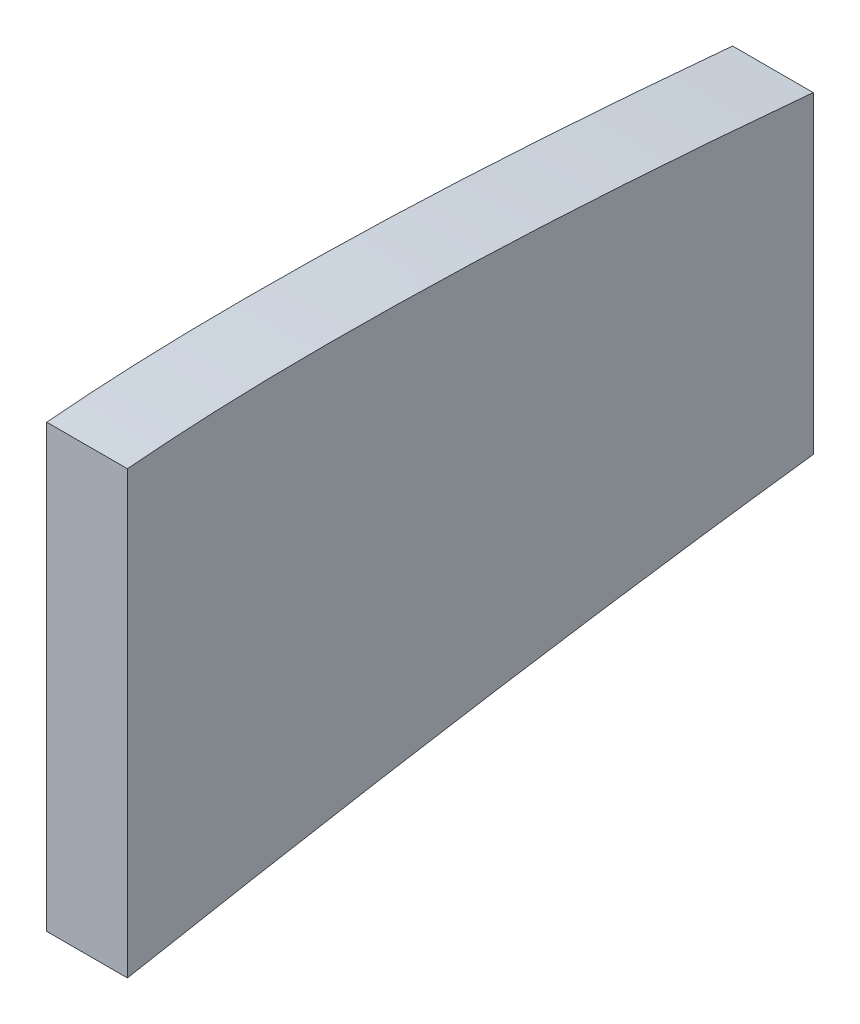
ISO-10303-21;
HEADER;
FILE_DESCRIPTION(('STEP AP214'),'2;1');
FILE_NAME('part.step','',(''),(''),'','','');
FILE_SCHEMA(('AUTOMOTIVE_DESIGN { 1 0 10303 214 1 1 1 1 }'));
ENDSEC;
DATA;
#1=APPLICATION_CONTEXT('core data for automotive mechanical design processes');
#2=APPLICATION_PROTOCOL_DEFINITION('international standard','automotive_design',2000,#1);
#3=PRODUCT_CONTEXT('',#1,'mechanical');
#4=PRODUCT('Part','Part','',(#3));
#5=PRODUCT_RELATED_PRODUCT_CATEGORY('part','',(#4));
#6=PRODUCT_DEFINITION_FORMATION('','',#4);
#7=PRODUCT_DEFINITION_CONTEXT('part definition',#1,'design');
#8=PRODUCT_DEFINITION('design','',#6,#7);
#9=PRODUCT_DEFINITION_SHAPE('','',#8);
#10=(LENGTH_UNIT() NAMED_UNIT(*) SI_UNIT(.MILLI.,.METRE.));
#11=(NAMED_UNIT(*) PLANE_ANGLE_UNIT() SI_UNIT($,.RADIAN.));
#12=(NAMED_UNIT(*) SI_UNIT($,.STERADIAN.) SOLID_ANGLE_UNIT());
#13=UNCERTAINTY_MEASURE_WITH_UNIT(LENGTH_MEASURE(1.E-05),#10,'distance_accuracy_value','');
#14=(GEOMETRIC_REPRESENTATION_CONTEXT(3) GLOBAL_UNCERTAINTY_ASSIGNED_CONTEXT((#13)) GLOBAL_UNIT_ASSIGNED_CONTEXT((#10,
#11,#12)) REPRESENTATION_CONTEXT('',''));
#15=CARTESIAN_POINT('',(0.,0.,0.));
#16=DIRECTION('',(0.,0.,1.));
#17=DIRECTION('',(1.,0.,0.));
#18=AXIS2_PLACEMENT_3D('',#15,#16,#17);
#19=CARTESIAN_POINT('',(3.175,18.8083146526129,-63.5));
#20=CARTESIAN_POINT('',(3.175,18.8858704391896,-62.6475131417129));
#21=CARTESIAN_POINT('',(3.175,19.1104930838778,-60.0791130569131));
#22=CARTESIAN_POINT('',(3.175,19.4275656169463,-55.8473773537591));
#23=CARTESIAN_POINT('',(3.175,19.6930976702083,-50.8648390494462));
#24=CARTESIAN_POINT('',(3.175,19.8086768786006,-46.0697414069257));
#25=CARTESIAN_POINT('',(3.175,19.7981278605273,-41.4866574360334));
#26=CARTESIAN_POINT('',(3.175,19.6365817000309,-38.3248971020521));
#27=CARTESIAN_POINT('',(3.175,19.4986830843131,-36.6955074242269));
#28=CARTESIAN_POINT('',(3.175,19.4825082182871,-36.5125));
#29=B_SPLINE_CURVE_WITH_KNOTS('',3,(#19,#20,#21,#22,#23,#24,#25,#26,#27,#28),.UNSPECIFIED.,.F.,
.F.,(4,1,1,1,1,1,1,4),(1.27949332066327,1.28788677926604,1.30477343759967,1.32110141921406,
1.33680606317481,1.35180003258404,1.36603106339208,1.36783234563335),.UNSPECIFIED.);
#30=DIRECTION('',(-1.,0.,0.));
#31=VECTOR('',#30,1.);
#32=SURFACE_OF_LINEAR_EXTRUSION('',#29,#31);
#33=CARTESIAN_POINT('',(0.,18.8083146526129,-63.5));
#34=CARTESIAN_POINT('',(0.,18.8858704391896,-62.6475131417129));
#35=CARTESIAN_POINT('',(0.,19.1104930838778,-60.0791130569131));
#36=CARTESIAN_POINT('',(0.,19.4275656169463,-55.8473773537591));
#37=CARTESIAN_POINT('',(0.,19.6930976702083,-50.8648390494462));
#38=CARTESIAN_POINT('',(0.,19.8086768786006,-46.0697414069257));
#39=CARTESIAN_POINT('',(0.,19.7981278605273,-41.4866574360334));
#40=CARTESIAN_POINT('',(0.,19.6365817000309,-38.3248971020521));
#41=CARTESIAN_POINT('',(0.,19.4986830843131,-36.6955074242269));
#42=CARTESIAN_POINT('',(0.,19.4825082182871,-36.5125));
#43=B_SPLINE_CURVE_WITH_KNOTS('',3,(#33,#34,#35,#36,#37,#38,#39,#40,#41,#42),.UNSPECIFIED.,.F.,
.F.,(4,1,1,1,1,1,1,4),(1.27949332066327,1.28788677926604,1.30477343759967,1.32110141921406,
1.33680606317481,1.35180003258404,1.36603106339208,1.36783234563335),.UNSPECIFIED.);
#44=CARTESIAN_POINT('',(0.,18.8083146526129,-63.5));
#45=VERTEX_POINT('',#44);
#46=CARTESIAN_POINT('',(0.,19.4825082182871,-36.5125));
#47=VERTEX_POINT('',#46);
#48=EDGE_CURVE('E116',#45,#47,#43,.T.);
#49=ORIENTED_EDGE('',*,*,#48,.T.);
#50=DIRECTION('',(-1.,0.,0.));
#51=VECTOR('',#50,1.);
#52=CARTESIAN_POINT('',(3.175,19.4825082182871,-36.5125));
#53=LINE('',#52,#51);
#54=CARTESIAN_POINT('',(3.175,19.4825082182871,-36.5125));
#55=VERTEX_POINT('',#54);
#56=EDGE_CURVE('E11',#55,#47,#53,.T.);
#57=ORIENTED_EDGE('',*,*,#56,.F.);
#58=CARTESIAN_POINT('',(3.175,18.8083146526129,-63.5));
#59=VERTEX_POINT('',#58);
#60=EDGE_CURVE('E85',#59,#55,#29,.T.);
#61=ORIENTED_EDGE('',*,*,#60,.F.);
#62=DIRECTION('',(-1.,0.,0.));
#63=VECTOR('',#62,1.);
#64=CARTESIAN_POINT('',(3.175,18.8083146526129,-63.5));
#65=LINE('',#64,#63);
#66=EDGE_CURVE('E93',#59,#45,#65,.T.);
#67=ORIENTED_EDGE('',*,*,#66,.T.);
#68=EDGE_LOOP('',(#49,#57,#61,#67));
#69=FACE_BOUND('',#68,.T.);
#70=ADVANCED_FACE('F33',(#69),#32,.F.);
#71=CARTESIAN_POINT('',(3.175,19.4825082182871,-36.5125));
#72=DIRECTION('',(0.,0.,-1.));
#73=DIRECTION('',(0.,1.,0.));
#74=AXIS2_PLACEMENT_3D('',#71,#72,#73);
#75=PLANE('',#74);
#76=DIRECTION('',(0.,-1.,0.));
#77=VECTOR('',#76,1.);
#78=CARTESIAN_POINT('',(0.,19.4825082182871,-36.5125));
#79=LINE('',#78,#77);
#80=CARTESIAN_POINT('',(0.,2.12827332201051,-36.5125));
#81=VERTEX_POINT('',#80);
#82=EDGE_CURVE('E89',#47,#81,#79,.T.);
#83=ORIENTED_EDGE('',*,*,#82,.T.);
#84=DIRECTION('',(-1.,0.,0.));
#85=VECTOR('',#84,1.);
#86=CARTESIAN_POINT('',(3.175,2.12827332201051,-36.5125));
#87=LINE('',#86,#85);
#88=CARTESIAN_POINT('',(3.175,2.12827332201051,-36.5125));
#89=VERTEX_POINT('',#88);
#90=EDGE_CURVE('E42',#89,#81,#87,.T.);
#91=ORIENTED_EDGE('',*,*,#90,.F.);
#92=DIRECTION('',(0.,-1.,0.));
#93=VECTOR('',#92,1.);
#94=CARTESIAN_POINT('',(3.175,19.4825082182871,-36.5125));
#95=LINE('',#94,#93);
#96=EDGE_CURVE('E80',#55,#89,#95,.T.);
#97=ORIENTED_EDGE('',*,*,#96,.F.);
#98=ORIENTED_EDGE('',*,*,#56,.T.);
#99=EDGE_LOOP('',(#83,#91,#97,#98));
#100=FACE_BOUND('',#99,.T.);
#101=ADVANCED_FACE('F88',(#100),#75,.F.);
#102=CARTESIAN_POINT('',(3.175,2.12827332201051,-36.5125));
#103=CARTESIAN_POINT('',(3.175,2.3724189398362,-37.8142768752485));
#104=CARTESIAN_POINT('',(3.175,2.98234789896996,-41.0984373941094));
#105=CARTESIAN_POINT('',(3.175,3.93804777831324,-46.4730338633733));
#106=CARTESIAN_POINT('',(3.175,4.96629213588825,-52.7259125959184));
#107=CARTESIAN_POINT('',(3.175,5.81263895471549,-58.4366348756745));
#108=CARTESIAN_POINT('',(3.175,6.29284186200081,-62.0593891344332));
#109=CARTESIAN_POINT('',(3.175,6.47451788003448,-63.5));
#110=B_SPLINE_CURVE_WITH_KNOTS('',3,(#102,#103,#104,#105,#106,#107,#108,#109),.UNSPECIFIED.,.F.,
.F.,(4,1,1,1,1,4),(0.636069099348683,0.649056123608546,0.668822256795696,0.689594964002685,
0.711189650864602,0.725427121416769),.UNSPECIFIED.);
#111=DIRECTION('',(-1.,0.,0.));
#112=VECTOR('',#111,1.);
#113=SURFACE_OF_LINEAR_EXTRUSION('',#110,#112);
#114=CARTESIAN_POINT('',(0.,2.12827332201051,-36.5125));
#115=CARTESIAN_POINT('',(0.,2.3724189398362,-37.8142768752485));
#116=CARTESIAN_POINT('',(0.,2.98234789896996,-41.0984373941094));
#117=CARTESIAN_POINT('',(0.,3.93804777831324,-46.4730338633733));
#118=CARTESIAN_POINT('',(0.,4.96629213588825,-52.7259125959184));
#119=CARTESIAN_POINT('',(0.,5.81263895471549,-58.4366348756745));
#120=CARTESIAN_POINT('',(0.,6.29284186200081,-62.0593891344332));
#121=CARTESIAN_POINT('',(0.,6.47451788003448,-63.5));
#122=B_SPLINE_CURVE_WITH_KNOTS('',3,(#114,#115,#116,#117,#118,#119,#120,#121),.UNSPECIFIED.,.F.,
.F.,(4,1,1,1,1,4),(0.636069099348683,0.649056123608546,0.668822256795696,0.689594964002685,
0.711189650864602,0.725427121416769),.UNSPECIFIED.);
#123=CARTESIAN_POINT('',(0.,6.47451788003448,-63.5));
#124=VERTEX_POINT('',#123);
#125=EDGE_CURVE('E67',#81,#124,#122,.T.);
#126=ORIENTED_EDGE('',*,*,#125,.T.);
#127=DIRECTION('',(-1.,0.,0.));
#128=VECTOR('',#127,1.);
#129=CARTESIAN_POINT('',(3.175,6.47451788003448,-63.5));
#130=LINE('',#129,#128);
#131=CARTESIAN_POINT('',(3.175,6.47451788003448,-63.5));
#132=VERTEX_POINT('',#131);
#133=EDGE_CURVE('E90',#132,#124,#130,.T.);
#134=ORIENTED_EDGE('',*,*,#133,.F.);
#135=EDGE_CURVE('E83',#89,#132,#110,.T.);
#136=ORIENTED_EDGE('',*,*,#135,.F.);
#137=ORIENTED_EDGE('',*,*,#90,.T.);
#138=EDGE_LOOP('',(#126,#134,#136,#137));
#139=FACE_BOUND('',#138,.T.);
#140=ADVANCED_FACE('F91',(#139),#113,.F.);
#141=CARTESIAN_POINT('',(3.175,18.8083146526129,-63.5));
#142=DIRECTION('',(0.,0.,1.));
#143=DIRECTION('',(1.,0.,0.));
#144=AXIS2_PLACEMENT_3D('',#141,#142,#143);
#145=PLANE('',#144);
#146=DIRECTION('',(0.,1.,0.));
#147=VECTOR('',#146,1.);
#148=CARTESIAN_POINT('',(0.,18.8083146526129,-63.5));
#149=LINE('',#148,#147);
#150=EDGE_CURVE('E73',#124,#45,#149,.T.);
#151=ORIENTED_EDGE('',*,*,#150,.T.);
#152=ORIENTED_EDGE('',*,*,#66,.F.);
#153=DIRECTION('',(0.,1.,0.));
#154=VECTOR('',#153,1.);
#155=CARTESIAN_POINT('',(3.175,18.8083146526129,-63.5));
#156=LINE('',#155,#154);
#157=EDGE_CURVE('E50',#132,#59,#156,.T.);
#158=ORIENTED_EDGE('',*,*,#157,.F.);
#159=ORIENTED_EDGE('',*,*,#133,.T.);
#160=EDGE_LOOP('',(#151,#152,#158,#159));
#161=FACE_BOUND('',#160,.T.);
#162=ADVANCED_FACE('F105',(#161),#145,.F.);
#163=CARTESIAN_POINT('',(3.175,19.7000164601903,-50.0172379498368));
#164=DIRECTION('',(-1.,0.,0.));
#165=DIRECTION('',(0.,0.,1.));
#166=AXIS2_PLACEMENT_3D('',#163,#164,#165);
#167=PLANE('',#166);
#168=ORIENTED_EDGE('',*,*,#60,.T.);
#169=ORIENTED_EDGE('',*,*,#96,.T.);
#170=ORIENTED_EDGE('',*,*,#135,.T.);
#171=ORIENTED_EDGE('',*,*,#157,.T.);
#172=EDGE_LOOP('',(#168,#169,#170,#171));
#173=FACE_BOUND('',#172,.T.);
#174=ADVANCED_FACE('F81',(#173),#167,.F.);
#175=CARTESIAN_POINT('',(0.,19.7000164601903,-50.0172379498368));
#176=DIRECTION('',(-1.,0.,0.));
#177=DIRECTION('',(0.,0.,1.));
#178=AXIS2_PLACEMENT_3D('',#175,#176,#177);
#179=PLANE('',#178);
#180=ORIENTED_EDGE('',*,*,#48,.F.);
#181=ORIENTED_EDGE('',*,*,#150,.F.);
#182=ORIENTED_EDGE('',*,*,#125,.F.);
#183=ORIENTED_EDGE('',*,*,#82,.F.);
#184=EDGE_LOOP('',(#180,#181,#182,#183));
#185=FACE_BOUND('',#184,.T.);
#186=ADVANCED_FACE('F133',(#185),#179,.T.);
#187=CLOSED_SHELL('',(#70,#101,#140,#162,#174,#186));
#188=MANIFOLD_SOLID_BREP('B2',#187);
#189=ADVANCED_BREP_SHAPE_REPRESENTATION('',(#18,#188),#14);
#190=SHAPE_DEFINITION_REPRESENTATION(#9,#189);
ENDSEC;
END-ISO-10303-21;
